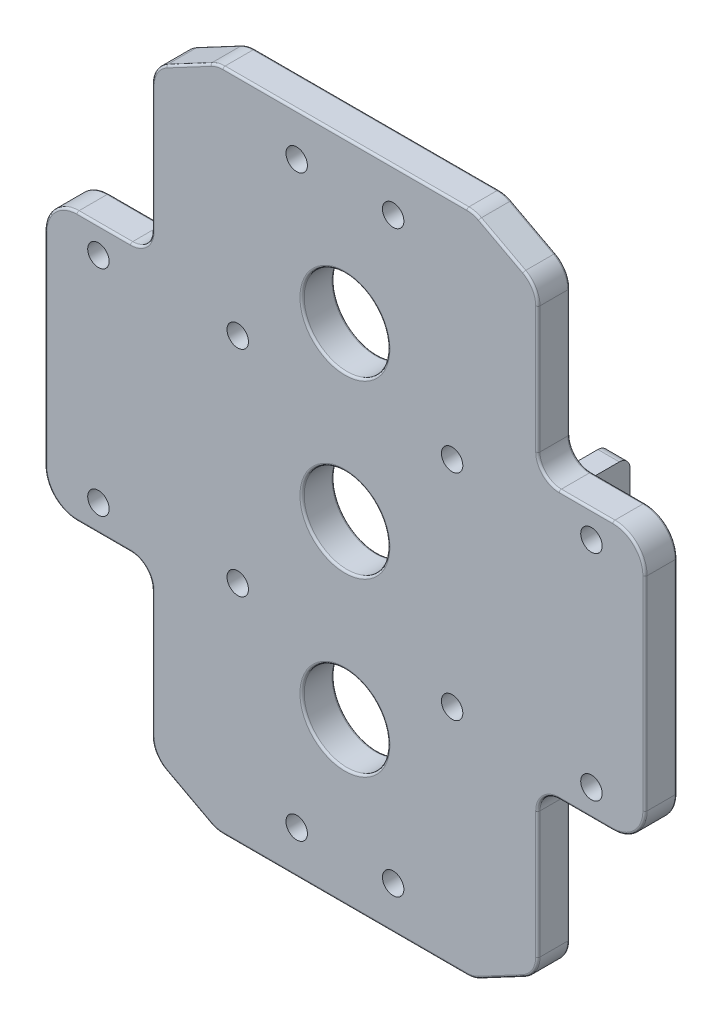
from build123d import *
from OCP.BRepFilletAPI import BRepFilletAPI_MakeChamfer

# Parameters (mm, degrees)
SKETCH_1_W             = 56
SKETCH_1_H             = 62
EXTRUDE_607_DEPTH      = 3
SKETCH_3_R             = 1
SKETCH_3_W             = 10
SKETCH_3_H             = 18.5
CUT_EXTRUDE_1681_DEPTH = 3
FILLET_1728_R          = 3
FILLET_3_R             = 2
SKETCH_4_R             = 4
CUT_EXTRUDE_2_DEPTH    = 10
SKETCH_6_W             = 2
SKETCH_6_H             = 22
EXTRUDE_2_DEPTH        = 4.6
FILLET_4_R             = 1
SKETCH_7_W             = 1
SKETCH_7_H             = 3.1
CUT_EXTRUDE_4439_DEPTH = 44
FILLET_5_R             = 0.2
CHAMFER_1_SIZE         = 6
CHAMFER_1_SIZE2        = 3.19025659
FILLET_6_R             = 2.5
FILLET_7_R             = 0.2


with BuildPart() as part:
    # Sketch 1 → Extrude 607 (new body)
    with BuildSketch(Plane.XY):
        Rectangle(SKETCH_1_W, SKETCH_1_H)
    extrude(amount=EXTRUDE_607_DEPTH)

    # Sketch 3 → Cut-Extrude 1681 (cut)
    with BuildSketch(Plane.XY.offset(3)):
        with Locations((23, -10)):
            Circle(SKETCH_3_R)
        with Locations(Location((23, 10, 0), (0, 0, 180))):
            Circle(SKETCH_3_R)
        with Locations((-23, 10)):
            Circle(SKETCH_3_R)
        with Locations(Location((-23, -10, 0), (0, 0, 180))):
            Circle(SKETCH_3_R)
        with Locations((10, -10)):
            Circle(SKETCH_3_R)
        with Locations(Location((10, 10, 0), (0, 0, 180))):
            Circle(SKETCH_3_R)
        with Locations((-10, 10)):
            Circle(SKETCH_3_R)
        with Locations(Location((-10, -10, 0), (0, 0, 180))):
            Circle(SKETCH_3_R)
        with Locations((-4.5, 27)):
            Circle(SKETCH_3_R)
        with Locations((4.5, 27)):
            Circle(SKETCH_3_R)
        with Locations(Location((4.5, -27, 0), (0, 0, 180))):
            Circle(SKETCH_3_R)
        with Locations(Location((-4.5, -27, 0), (0, 0, 180))):
            Circle(SKETCH_3_R)
        with Locations((23, -21.75)):
            Rectangle(SKETCH_3_W, SKETCH_3_H)
        with Locations((23, 21.75)):
            Rectangle(SKETCH_3_W, SKETCH_3_H)
        with Locations((-23, -21.75)):
            Rectangle(SKETCH_3_W, SKETCH_3_H)
        with Locations((-23, 21.75)):
            Rectangle(SKETCH_3_W, SKETCH_3_H)
    extrude(amount=-CUT_EXTRUDE_1681_DEPTH, mode=Mode.SUBTRACT)

    # Fillet 1728
    fillet_1728_edges = [part.edges().sort_by_distance(p)[0] for p in [
        (28, -12.5, 1.5),
        (28, 12.5, 1.5),
        (-28, -12.5, 1.5),
        (-28, 12.5, 1.5),
    ]]
    fillet(fillet_1728_edges, radius=FILLET_1728_R)

    # Fillet 3
    fillet_3_edges = [part.edges().sort_by_distance(p)[0] for p in [
        (18, -12.5, 1.5),
        (18, 12.5, 1.5),
        (-18, -12.5, 1.5),
        (-18, 12.5, 1.5),
    ]]
    fillet(fillet_3_edges, radius=FILLET_3_R)

    # Sketch 4 → Cut-Extrude 2 (cut)
    with BuildSketch(Plane.XY.offset(3)):
        Circle(SKETCH_4_R)
        with Locations((0, -16)):
            Circle(SKETCH_4_R)
        with Locations((0, 16)):
            Circle(SKETCH_4_R)
    extrude(amount=-CUT_EXTRUDE_2_DEPTH, mode=Mode.SUBTRACT)

    # Sketch 6 → Extrude 2 (add)
    with BuildSketch(Plane(origin=(0, 0, 0), x_dir=(-1, 0, 0), z_dir=(0, 0, -1))):
        with Locations((18, 0)):
            Rectangle(SKETCH_6_W, SKETCH_6_H)
        with Locations((-18, 0)):
            Rectangle(SKETCH_6_W, SKETCH_6_H)
    extrude(amount=EXTRUDE_2_DEPTH)

    # Fillet 4
    fillet_4_edges = [part.edges().sort_by_distance(p)[0] for p in [
        (18, -11, -4.6),
        (18, 11, -4.6),
        (-18, -11, -4.6),
        (-18, 11, -4.6),
    ]]
    fillet(fillet_4_edges, radius=FILLET_4_R)

    # Sketch 7 → Cut-Extrude 4439 (cut)
    with BuildSketch(Plane.ZY.offset(19)):
        with Locations((-3, 7.4)):
            Rectangle(SKETCH_7_W, SKETCH_7_H)
        with Locations((-3, -7.4)):
            Rectangle(SKETCH_7_W, SKETCH_7_H)
    extrude(amount=-CUT_EXTRUDE_4439_DEPTH, mode=Mode.SUBTRACT)

    # Fillet 5
    fillet_5_edges = [part.edges().sort_by_distance(p)[0] for p in [
        (19, 0, 0),
        (18, -11, 0),
        (17, 0, 0),
        (18, 11, 0),
        (-17, 0, 0),
        (-18, -11, 0),
        (-19, 0, 0),
        (-18, 11, 0),
        (18, 5.85, -3.5),
        (-18, 5.85, -3.5),
        (18, 8.95, -3.5),
        (-18, 8.95, -3.5),
        (18, 8.95, -2.5),
        (-18, 8.95, -2.5),
        (18, 5.85, -2.5),
        (-18, 5.85, -2.5),
        (18, -5.85, -2.5),
        (-18, -5.85, -2.5),
        (18, -8.95, -2.5),
        (-18, -8.95, -2.5),
        (18, -8.95, -3.5),
        (-18, -8.95, -3.5),
        (18, -5.85, -3.5),
        (-18, -5.85, -3.5),
    ]]
    fillet(fillet_5_edges, radius=FILLET_5_R)

    # Chamfer 1: one chamfer whose edges measure the first distance from different faces: ONE call of the kernel's chamfer builder (chamfer() names one face for all edges)
    chamfer_1_edges_1 = [part.edges().sort_by_distance(p)[0] for p in [
        (18, -31, 1.5),
        (-18, -31, 1.5),
    ]]
    chamfer_1_side_1 = [part.faces().sort_by_distance(p)[0] for p in [
        (0, -31, 1.5),
    ]]
    chamfer_1_edges_2 = [part.edges().sort_by_distance(p)[0] for p in [
        (18, 31, 1.5),
        (-18, 31, 1.5),
    ]]
    chamfer_1_side_2 = [part.faces().sort_by_distance(p)[0] for p in [
        (0, 31, 1.5),
    ]]
    chamfer_1 = BRepFilletAPI_MakeChamfer(part.part.solid().wrapped)
    for e in chamfer_1_edges_1:
        chamfer_1.Add(CHAMFER_1_SIZE, CHAMFER_1_SIZE2, e.wrapped, chamfer_1_side_1[0].wrapped)  # the first distance lies on this face
    for e in chamfer_1_edges_2:
        chamfer_1.Add(CHAMFER_1_SIZE, CHAMFER_1_SIZE2, e.wrapped, chamfer_1_side_2[0].wrapped)  # the first distance lies on this face
    add(Compound.cast(chamfer_1.Shape()), mode=Mode.REPLACE)

    # Fillet 6
    fillet_6_edges = [part.edges().sort_by_distance(p)[0] for p in [
        (18, 27.80974341, 1.5),
        (-12, 31, 1.5),
        (12, 31, 1.5),
        (-18, 27.80974341, 1.5),
        (-12, -31, 1.5),
        (12, -31, 1.5),
        (18, -27.80974341, 1.5),
        (-18, -27.80974341, 1.5),
    ]]
    fillet(fillet_6_edges, radius=FILLET_6_R)

    # Fillet 7
    fillet_7_edges = [part.edges().sort_by_distance(p)[0] for p in [
        (22.5, -12.5, 3),
        (22.5, -12.5, 0),
        (-22.5, 12.5, 3),
        (-28, 0, 3),
        (28, 0, 3),
        (27.121320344, 11.621320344, 3),
        (-27.121320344, 11.621320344, 3),
        (-27.121320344, -11.621320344, 3),
        (27.121320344, -11.621320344, 3),
        (28, 0, 0),
        (-28, 0, 0),
        (-22.5, 12.5, 0),
        (27.121320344, 11.621320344, 0),
        (-27.121320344, 11.621320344, 0),
        (-27.121320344, -11.621320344, 0),
        (27.121320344, -11.621320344, 0),
        (18, -20.403795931, 3),
        (18, -20.403795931, 0),
        (-22.5, -12.5, 3),
        (-22.5, -12.5, 0),
        (-18, 20.403795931, 3),
        (-18, 20.403795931, 0),
        (22.5, 12.5, 3),
        (22.5, 12.5, 0),
        (18.585786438, -13.085786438, 3),
        (18.585786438, -13.085786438, 0),
        (-18.585786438, -13.085786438, 3),
        (-18.585786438, -13.085786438, 0),
        (-18.585786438, 13.085786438, 3),
        (-18.585786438, 13.085786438, 0),
        (18.585786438, 13.085786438, 3),
        (18.585786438, 13.085786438, 0),
        (-4, 0, 0),
        (-4, 0, 3),
        (-4, -16, 0),
        (-4, -16, 3),
        (-4, 16, 3),
        (-4, 16, 0),
        (0, 31, 0),
        (14.612018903, 29.611164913, 0),
        (18, 20.403795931, 0),
        (14.612018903, -29.611164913, 0),
        (0, -31, 0),
        (-14.612018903, -29.611164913, 0),
        (-18, -20.403795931, 0),
        (-14.612018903, 29.611164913, 0),
        (17.642918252, 27.59518705, 0),
        (11.981484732, 30.925739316, 0),
        (-11.981484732, 30.925739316, 0),
        (-17.642918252, 27.59518705, 0),
        (-17.642918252, -27.59518705, 0),
        (-11.981484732, -30.925739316, 0),
        (11.981484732, -30.925739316, 0),
        (17.642918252, -27.59518705, 0),
        (14.612018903, -29.611164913, 3),
        (18, 20.403795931, 3),
        (14.612018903, 29.611164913, 3),
        (0, 31, 3),
        (-14.612018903, 29.611164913, 3),
        (-18, -20.403795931, 3),
        (-14.612018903, -29.611164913, 3),
        (0, -31, 3),
        (17.642918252, 27.59518705, 3),
        (11.981484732, 30.925739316, 3),
        (-11.981484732, 30.925739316, 3),
        (-17.642918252, 27.59518705, 3),
        (-17.642918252, -27.59518705, 3),
        (-11.981484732, -30.925739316, 3),
        (11.981484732, -30.925739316, 3),
        (17.642918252, -27.59518705, 3),
    ]]
    fillet(fillet_7_edges, radius=FILLET_7_R)


solid = part.part
